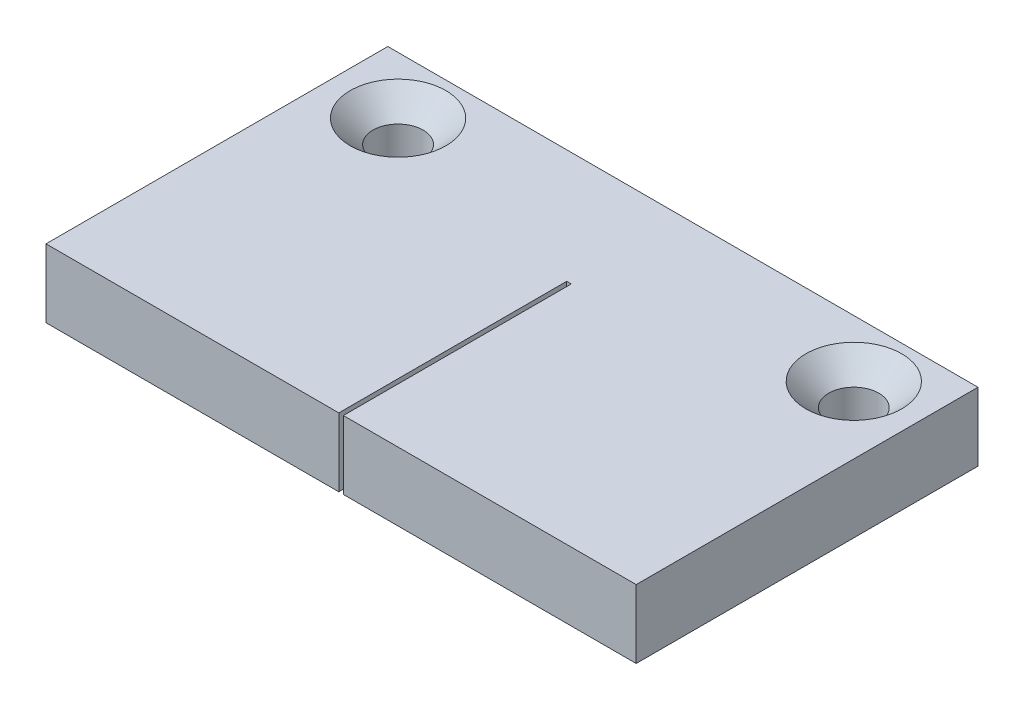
ISO-10303-21;
HEADER;
FILE_DESCRIPTION(('STEP AP214'),'2;1');
FILE_NAME('part.step','',(''),(''),'','','');
FILE_SCHEMA(('AUTOMOTIVE_DESIGN { 1 0 10303 214 1 1 1 1 }'));
ENDSEC;
DATA;
#1=APPLICATION_CONTEXT('core data for automotive mechanical design processes');
#2=APPLICATION_PROTOCOL_DEFINITION('international standard','automotive_design',2000,#1);
#3=PRODUCT_CONTEXT('',#1,'mechanical');
#4=PRODUCT('Part','Part','',(#3));
#5=PRODUCT_RELATED_PRODUCT_CATEGORY('part','',(#4));
#6=PRODUCT_DEFINITION_FORMATION('','',#4);
#7=PRODUCT_DEFINITION_CONTEXT('part definition',#1,'design');
#8=PRODUCT_DEFINITION('design','',#6,#7);
#9=PRODUCT_DEFINITION_SHAPE('','',#8);
#10=(LENGTH_UNIT() NAMED_UNIT(*) SI_UNIT(.MILLI.,.METRE.));
#11=(NAMED_UNIT(*) PLANE_ANGLE_UNIT() SI_UNIT($,.RADIAN.));
#12=(NAMED_UNIT(*) SI_UNIT($,.STERADIAN.) SOLID_ANGLE_UNIT());
#13=UNCERTAINTY_MEASURE_WITH_UNIT(LENGTH_MEASURE(1.E-05),#10,'distance_accuracy_value','');
#14=(GEOMETRIC_REPRESENTATION_CONTEXT(3) GLOBAL_UNCERTAINTY_ASSIGNED_CONTEXT((#13)) GLOBAL_UNIT_ASSIGNED_CONTEXT((#10,
#11,#12)) REPRESENTATION_CONTEXT('',''));
#15=CARTESIAN_POINT('',(0.,0.,0.));
#16=DIRECTION('',(0.,0.,1.));
#17=DIRECTION('',(1.,0.,0.));
#18=AXIS2_PLACEMENT_3D('',#15,#16,#17);
#19=CARTESIAN_POINT('',(10.,2.9999999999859,2.5));
#20=DIRECTION('',(0.,1.,0.));
#21=DIRECTION('',(0.,0.,1.));
#22=AXIS2_PLACEMENT_3D('',#19,#20,#21);
#23=CONICAL_SURFACE('',#22,2.09999999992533,0.78539816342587);
#24=CARTESIAN_POINT('',(10.,3.00000000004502,2.5));
#25=DIRECTION('',(0.,1.,0.));
#26=DIRECTION('',(0.,0.,1.));
#27=AXIS2_PLACEMENT_3D('',#24,#25,#26);
#28=CIRCLE('',#27,2.09999999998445);
#29=CARTESIAN_POINT('',(10.,3.00000000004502,4.59999999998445));
#30=VERTEX_POINT('',#29);
#31=EDGE_CURVE('E102',#30,#30,#28,.F.);
#32=ORIENTED_EDGE('',*,*,#31,.F.);
#33=EDGE_LOOP('',(#32));
#34=FACE_BOUND('',#33,.T.);
#35=CARTESIAN_POINT('',(10.,2.00000000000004,2.5));
#36=DIRECTION('',(0.,1.,0.));
#37=DIRECTION('',(-1.,0.,0.));
#38=AXIS2_PLACEMENT_3D('',#35,#36,#37);
#39=CIRCLE('',#38,1.1);
#40=CARTESIAN_POINT('',(8.90000000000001,2.00000000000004,2.5));
#41=VERTEX_POINT('',#40);
#42=EDGE_CURVE('E101',#41,#41,#39,.F.);
#43=ORIENTED_EDGE('',*,*,#42,.T.);
#44=EDGE_LOOP('',(#43));
#45=FACE_BOUND('',#44,.T.);
#46=ADVANCED_FACE('F16',(#34,#45),#23,.F.);
#47=CARTESIAN_POINT('',(-10.,2.9999999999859,2.5));
#48=DIRECTION('',(0.,1.,0.));
#49=DIRECTION('',(0.,0.,1.));
#50=AXIS2_PLACEMENT_3D('',#47,#48,#49);
#51=CONICAL_SURFACE('',#50,2.10000000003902,0.785398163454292);
#52=CARTESIAN_POINT('',(-10.,3.00000000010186,2.5));
#53=DIRECTION('',(0.,1.,0.));
#54=DIRECTION('',(0.,0.,1.));
#55=AXIS2_PLACEMENT_3D('',#52,#53,#54);
#56=CIRCLE('',#55,2.10000000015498);
#57=CARTESIAN_POINT('',(-10.,3.00000000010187,4.60000000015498));
#58=VERTEX_POINT('',#57);
#59=EDGE_CURVE('E19',#58,#58,#56,.F.);
#60=ORIENTED_EDGE('',*,*,#59,.F.);
#61=EDGE_LOOP('',(#60));
#62=FACE_BOUND('',#61,.T.);
#63=CARTESIAN_POINT('',(-10.,2.,2.5));
#64=DIRECTION('',(0.,1.,0.));
#65=DIRECTION('',(-1.,0.,0.));
#66=AXIS2_PLACEMENT_3D('',#63,#64,#65);
#67=CIRCLE('',#66,1.1);
#68=CARTESIAN_POINT('',(-11.1,2.,2.5));
#69=VERTEX_POINT('',#68);
#70=EDGE_CURVE('E112',#69,#69,#67,.F.);
#71=ORIENTED_EDGE('',*,*,#70,.T.);
#72=EDGE_LOOP('',(#71));
#73=FACE_BOUND('',#72,.T.);
#74=ADVANCED_FACE('F133',(#62,#73),#51,.F.);
#75=CARTESIAN_POINT('',(-0.099999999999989,0.,5.));
#76=DIRECTION('',(0.,0.,-1.));
#77=DIRECTION('',(-1.,0.,0.));
#78=AXIS2_PLACEMENT_3D('',#75,#76,#77);
#79=PLANE('',#78);
#80=DIRECTION('',(0.,-1.,0.));
#81=VECTOR('',#80,1.);
#82=CARTESIAN_POINT('',(-0.099999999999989,0.,5.));
#83=LINE('',#82,#81);
#84=CARTESIAN_POINT('',(-0.099999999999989,3.,5.));
#85=VERTEX_POINT('',#84);
#86=CARTESIAN_POINT('',(-0.099999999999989,0.,5.));
#87=VERTEX_POINT('',#86);
#88=EDGE_CURVE('E84',#85,#87,#83,.T.);
#89=ORIENTED_EDGE('',*,*,#88,.T.);
#90=DIRECTION('',(-1.,0.,0.));
#91=VECTOR('',#90,1.);
#92=CARTESIAN_POINT('',(-0.099999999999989,0.,5.));
#93=LINE('',#92,#91);
#94=CARTESIAN_POINT('',(0.099999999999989,0.,5.));
#95=VERTEX_POINT('',#94);
#96=EDGE_CURVE('E114',#95,#87,#93,.T.);
#97=ORIENTED_EDGE('',*,*,#96,.F.);
#98=DIRECTION('',(0.,1.,0.));
#99=VECTOR('',#98,1.);
#100=CARTESIAN_POINT('',(0.099999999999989,0.,5.));
#101=LINE('',#100,#99);
#102=CARTESIAN_POINT('',(0.099999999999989,3.,5.));
#103=VERTEX_POINT('',#102);
#104=EDGE_CURVE('E98',#95,#103,#101,.T.);
#105=ORIENTED_EDGE('',*,*,#104,.T.);
#106=DIRECTION('',(-1.,0.,0.));
#107=VECTOR('',#106,1.);
#108=CARTESIAN_POINT('',(0.,3.,5.));
#109=LINE('',#108,#107);
#110=EDGE_CURVE('E95',#85,#103,#109,.F.);
#111=ORIENTED_EDGE('',*,*,#110,.F.);
#112=EDGE_LOOP('',(#89,#97,#105,#111));
#113=FACE_BOUND('',#112,.T.);
#114=ADVANCED_FACE('F96',(#113),#79,.F.);
#115=CARTESIAN_POINT('',(0.,3.,0.));
#116=DIRECTION('',(0.,1.,0.));
#117=DIRECTION('',(-1.,0.,0.));
#118=AXIS2_PLACEMENT_3D('',#115,#116,#117);
#119=PLANE('',#118);
#120=DIRECTION('',(-1.,0.,0.));
#121=VECTOR('',#120,1.);
#122=CARTESIAN_POINT('',(12.95,3.,0.));
#123=LINE('',#122,#121);
#124=CARTESIAN_POINT('',(-12.95,3.,0.));
#125=VERTEX_POINT('',#124);
#126=CARTESIAN_POINT('',(12.95,3.00000000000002,0.));
#127=VERTEX_POINT('',#126);
#128=EDGE_CURVE('E272',#125,#127,#123,.F.);
#129=ORIENTED_EDGE('',*,*,#128,.F.);
#130=DIRECTION('',(0.,0.,1.));
#131=VECTOR('',#130,1.);
#132=CARTESIAN_POINT('',(-12.95,3.,0.));
#133=LINE('',#132,#131);
#134=CARTESIAN_POINT('',(-12.95,3.,15.));
#135=VERTEX_POINT('',#134);
#136=EDGE_CURVE('E126',#135,#125,#133,.F.);
#137=ORIENTED_EDGE('',*,*,#136,.F.);
#138=DIRECTION('',(1.,0.,0.));
#139=VECTOR('',#138,1.);
#140=CARTESIAN_POINT('',(-12.95,3.,15.));
#141=LINE('',#140,#139);
#142=CARTESIAN_POINT('',(-0.099999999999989,3.,15.));
#143=VERTEX_POINT('',#142);
#144=EDGE_CURVE('E78',#143,#135,#141,.F.);
#145=ORIENTED_EDGE('',*,*,#144,.F.);
#146=DIRECTION('',(0.,0.,1.));
#147=VECTOR('',#146,1.);
#148=CARTESIAN_POINT('',(-0.099999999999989,3.,15.));
#149=LINE('',#148,#147);
#150=EDGE_CURVE('E87',#143,#85,#149,.F.);
#151=ORIENTED_EDGE('',*,*,#150,.T.);
#152=ORIENTED_EDGE('',*,*,#110,.T.);
#153=DIRECTION('',(0.,0.,1.));
#154=VECTOR('',#153,1.);
#155=CARTESIAN_POINT('',(0.099999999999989,3.,5.));
#156=LINE('',#155,#154);
#157=CARTESIAN_POINT('',(0.099999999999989,3.00000000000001,15.));
#158=VERTEX_POINT('',#157);
#159=EDGE_CURVE('E107',#103,#158,#156,.T.);
#160=ORIENTED_EDGE('',*,*,#159,.T.);
#161=DIRECTION('',(1.,0.,0.));
#162=VECTOR('',#161,1.);
#163=CARTESIAN_POINT('',(-12.95,3.00000000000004,15.));
#164=LINE('',#163,#162);
#165=CARTESIAN_POINT('',(12.95,3.00000000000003,15.));
#166=VERTEX_POINT('',#165);
#167=EDGE_CURVE('E288',#166,#158,#164,.F.);
#168=ORIENTED_EDGE('',*,*,#167,.F.);
#169=DIRECTION('',(0.,0.,1.));
#170=VECTOR('',#169,1.);
#171=CARTESIAN_POINT('',(12.95,3.00000000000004,15.));
#172=LINE('',#171,#170);
#173=EDGE_CURVE('E281',#127,#166,#172,.T.);
#174=ORIENTED_EDGE('',*,*,#173,.F.);
#175=EDGE_LOOP('',(#129,#137,#145,#151,#152,#160,#168,#174));
#176=FACE_BOUND('',#175,.T.);
#177=ORIENTED_EDGE('',*,*,#31,.T.);
#178=EDGE_LOOP('',(#177));
#179=FACE_BOUND('',#178,.T.);
#180=ORIENTED_EDGE('',*,*,#59,.T.);
#181=EDGE_LOOP('',(#180));
#182=FACE_BOUND('',#181,.T.);
#183=ADVANCED_FACE('F104',(#176,#179,#182),#119,.T.);
#184=CARTESIAN_POINT('',(10.,0.,2.5));
#185=DIRECTION('',(0.,1.,0.));
#186=DIRECTION('',(-1.,0.,0.));
#187=AXIS2_PLACEMENT_3D('',#184,#185,#186);
#188=CYLINDRICAL_SURFACE('',#187,1.1);
#189=ORIENTED_EDGE('',*,*,#42,.F.);
#190=EDGE_LOOP('',(#189));
#191=FACE_BOUND('',#190,.T.);
#192=CARTESIAN_POINT('',(10.,0.,2.5));
#193=DIRECTION('',(0.,1.,0.));
#194=DIRECTION('',(-1.,0.,0.));
#195=AXIS2_PLACEMENT_3D('',#192,#193,#194);
#196=CIRCLE('',#195,1.1);
#197=CARTESIAN_POINT('',(8.90000000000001,0.,2.5));
#198=VERTEX_POINT('',#197);
#199=EDGE_CURVE('E124',#198,#198,#196,.F.);
#200=ORIENTED_EDGE('',*,*,#199,.T.);
#201=EDGE_LOOP('',(#200));
#202=FACE_BOUND('',#201,.T.);
#203=ADVANCED_FACE('F142',(#191,#202),#188,.F.);
#204=CARTESIAN_POINT('',(-10.,0.,2.5));
#205=DIRECTION('',(0.,1.,0.));
#206=DIRECTION('',(-1.,0.,0.));
#207=AXIS2_PLACEMENT_3D('',#204,#205,#206);
#208=CYLINDRICAL_SURFACE('',#207,1.1);
#209=ORIENTED_EDGE('',*,*,#70,.F.);
#210=EDGE_LOOP('',(#209));
#211=FACE_BOUND('',#210,.T.);
#212=CARTESIAN_POINT('',(-10.,0.,2.5));
#213=DIRECTION('',(0.,1.,0.));
#214=DIRECTION('',(-1.,0.,0.));
#215=AXIS2_PLACEMENT_3D('',#212,#213,#214);
#216=CIRCLE('',#215,1.1);
#217=CARTESIAN_POINT('',(-11.1,0.,2.5));
#218=VERTEX_POINT('',#217);
#219=EDGE_CURVE('E120',#218,#218,#216,.F.);
#220=ORIENTED_EDGE('',*,*,#219,.T.);
#221=EDGE_LOOP('',(#220));
#222=FACE_BOUND('',#221,.T.);
#223=ADVANCED_FACE('F138',(#211,#222),#208,.F.);
#224=CARTESIAN_POINT('',(-12.95,0.,15.));
#225=DIRECTION('',(0.,0.,1.));
#226=DIRECTION('',(1.,0.,0.));
#227=AXIS2_PLACEMENT_3D('',#224,#225,#226);
#228=PLANE('',#227);
#229=ORIENTED_EDGE('',*,*,#144,.T.);
#230=DIRECTION('',(0.,-1.,0.));
#231=VECTOR('',#230,1.);
#232=CARTESIAN_POINT('',(-12.95,0.,15.));
#233=LINE('',#232,#231);
#234=CARTESIAN_POINT('',(-12.95,0.,15.));
#235=VERTEX_POINT('',#234);
#236=EDGE_CURVE('E268',#235,#135,#233,.F.);
#237=ORIENTED_EDGE('',*,*,#236,.F.);
#238=DIRECTION('',(-1.,0.,0.));
#239=VECTOR('',#238,1.);
#240=CARTESIAN_POINT('',(0.,0.,15.));
#241=LINE('',#240,#239);
#242=CARTESIAN_POINT('',(-0.099999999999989,0.,15.));
#243=VERTEX_POINT('',#242);
#244=EDGE_CURVE('E123',#235,#243,#241,.F.);
#245=ORIENTED_EDGE('',*,*,#244,.T.);
#246=DIRECTION('',(0.,-1.,0.));
#247=VECTOR('',#246,1.);
#248=CARTESIAN_POINT('',(-0.099999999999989,0.,15.));
#249=LINE('',#248,#247);
#250=EDGE_CURVE('E92',#243,#143,#249,.F.);
#251=ORIENTED_EDGE('',*,*,#250,.T.);
#252=EDGE_LOOP('',(#229,#237,#245,#251));
#253=FACE_BOUND('',#252,.T.);
#254=ADVANCED_FACE('F141',(#253),#228,.T.);
#255=CARTESIAN_POINT('',(-0.099999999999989,0.,15.));
#256=DIRECTION('',(-1.,0.,0.));
#257=DIRECTION('',(0.,-1.,0.));
#258=AXIS2_PLACEMENT_3D('',#255,#256,#257);
#259=PLANE('',#258);
#260=ORIENTED_EDGE('',*,*,#250,.F.);
#261=DIRECTION('',(0.,0.,1.));
#262=VECTOR('',#261,1.);
#263=CARTESIAN_POINT('',(-0.099999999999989,0.,0.));
#264=LINE('',#263,#262);
#265=EDGE_CURVE('E90',#243,#87,#264,.F.);
#266=ORIENTED_EDGE('',*,*,#265,.T.);
#267=ORIENTED_EDGE('',*,*,#88,.F.);
#268=ORIENTED_EDGE('',*,*,#150,.F.);
#269=EDGE_LOOP('',(#260,#266,#267,#268));
#270=FACE_BOUND('',#269,.T.);
#271=ADVANCED_FACE('F86',(#270),#259,.F.);
#272=CARTESIAN_POINT('',(0.099999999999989,0.,5.));
#273=DIRECTION('',(1.,0.,0.));
#274=DIRECTION('',(0.,1.,0.));
#275=AXIS2_PLACEMENT_3D('',#272,#273,#274);
#276=PLANE('',#275);
#277=ORIENTED_EDGE('',*,*,#104,.F.);
#278=DIRECTION('',(0.,0.,1.));
#279=VECTOR('',#278,1.);
#280=CARTESIAN_POINT('',(0.099999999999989,0.,0.));
#281=LINE('',#280,#279);
#282=CARTESIAN_POINT('',(0.099999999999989,0.,15.));
#283=VERTEX_POINT('',#282);
#284=EDGE_CURVE('E292',#95,#283,#281,.T.);
#285=ORIENTED_EDGE('',*,*,#284,.T.);
#286=DIRECTION('',(0.,1.,0.));
#287=VECTOR('',#286,1.);
#288=CARTESIAN_POINT('',(0.099999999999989,0.,15.));
#289=LINE('',#288,#287);
#290=EDGE_CURVE('E286',#158,#283,#289,.F.);
#291=ORIENTED_EDGE('',*,*,#290,.F.);
#292=ORIENTED_EDGE('',*,*,#159,.F.);
#293=EDGE_LOOP('',(#277,#285,#291,#292));
#294=FACE_BOUND('',#293,.T.);
#295=ADVANCED_FACE('F207',(#294),#276,.F.);
#296=CARTESIAN_POINT('',(-12.95,0.,15.));
#297=DIRECTION('',(0.,0.,1.));
#298=DIRECTION('',(1.,0.,0.));
#299=AXIS2_PLACEMENT_3D('',#296,#297,#298);
#300=PLANE('',#299);
#301=DIRECTION('',(-1.,0.,0.));
#302=VECTOR('',#301,1.);
#303=CARTESIAN_POINT('',(0.,0.,15.));
#304=LINE('',#303,#302);
#305=CARTESIAN_POINT('',(12.95,0.,15.));
#306=VERTEX_POINT('',#305);
#307=EDGE_CURVE('E296',#283,#306,#304,.F.);
#308=ORIENTED_EDGE('',*,*,#307,.T.);
#309=DIRECTION('',(0.,1.,0.));
#310=VECTOR('',#309,1.);
#311=CARTESIAN_POINT('',(12.95,0.,15.));
#312=LINE('',#311,#310);
#313=EDGE_CURVE('E284',#166,#306,#312,.F.);
#314=ORIENTED_EDGE('',*,*,#313,.F.);
#315=ORIENTED_EDGE('',*,*,#167,.T.);
#316=ORIENTED_EDGE('',*,*,#290,.T.);
#317=EDGE_LOOP('',(#308,#314,#315,#316));
#318=FACE_BOUND('',#317,.T.);
#319=ADVANCED_FACE('F216',(#318),#300,.T.);
#320=CARTESIAN_POINT('',(12.95,0.,15.));
#321=DIRECTION('',(1.,0.,0.));
#322=DIRECTION('',(0.,1.,0.));
#323=AXIS2_PLACEMENT_3D('',#320,#321,#322);
#324=PLANE('',#323);
#325=DIRECTION('',(0.,1.,0.));
#326=VECTOR('',#325,1.);
#327=CARTESIAN_POINT('',(12.95,0.,0.));
#328=LINE('',#327,#326);
#329=CARTESIAN_POINT('',(12.95,0.,0.));
#330=VERTEX_POINT('',#329);
#331=EDGE_CURVE('E279',#127,#330,#328,.F.);
#332=ORIENTED_EDGE('',*,*,#331,.F.);
#333=ORIENTED_EDGE('',*,*,#173,.T.);
#334=ORIENTED_EDGE('',*,*,#313,.T.);
#335=DIRECTION('',(0.,0.,1.));
#336=VECTOR('',#335,1.);
#337=CARTESIAN_POINT('',(12.95,0.,0.));
#338=LINE('',#337,#336);
#339=EDGE_CURVE('E300',#306,#330,#338,.F.);
#340=ORIENTED_EDGE('',*,*,#339,.T.);
#341=EDGE_LOOP('',(#332,#333,#334,#340));
#342=FACE_BOUND('',#341,.T.);
#343=ADVANCED_FACE('F226',(#342),#324,.T.);
#344=CARTESIAN_POINT('',(12.95,0.,0.));
#345=DIRECTION('',(0.,0.,-1.));
#346=DIRECTION('',(-1.,0.,0.));
#347=AXIS2_PLACEMENT_3D('',#344,#345,#346);
#348=PLANE('',#347);
#349=DIRECTION('',(0.,-1.,0.));
#350=VECTOR('',#349,1.);
#351=CARTESIAN_POINT('',(-12.95,0.,0.));
#352=LINE('',#351,#350);
#353=CARTESIAN_POINT('',(-12.95,0.,0.));
#354=VERTEX_POINT('',#353);
#355=EDGE_CURVE('E33',#125,#354,#352,.T.);
#356=ORIENTED_EDGE('',*,*,#355,.F.);
#357=ORIENTED_EDGE('',*,*,#128,.T.);
#358=ORIENTED_EDGE('',*,*,#331,.T.);
#359=DIRECTION('',(-1.,0.,0.));
#360=VECTOR('',#359,1.);
#361=CARTESIAN_POINT('',(0.,0.,0.));
#362=LINE('',#361,#360);
#363=EDGE_CURVE('E25',#330,#354,#362,.T.);
#364=ORIENTED_EDGE('',*,*,#363,.T.);
#365=EDGE_LOOP('',(#356,#357,#358,#364));
#366=FACE_BOUND('',#365,.T.);
#367=ADVANCED_FACE('F236',(#366),#348,.T.);
#368=CARTESIAN_POINT('',(-12.95,0.,0.));
#369=DIRECTION('',(-1.,0.,0.));
#370=DIRECTION('',(0.,-1.,0.));
#371=AXIS2_PLACEMENT_3D('',#368,#369,#370);
#372=PLANE('',#371);
#373=ORIENTED_EDGE('',*,*,#236,.T.);
#374=ORIENTED_EDGE('',*,*,#136,.T.);
#375=ORIENTED_EDGE('',*,*,#355,.T.);
#376=DIRECTION('',(0.,0.,1.));
#377=VECTOR('',#376,1.);
#378=CARTESIAN_POINT('',(-12.95,0.,0.));
#379=LINE('',#378,#377);
#380=EDGE_CURVE('E11',#354,#235,#379,.T.);
#381=ORIENTED_EDGE('',*,*,#380,.T.);
#382=EDGE_LOOP('',(#373,#374,#375,#381));
#383=FACE_BOUND('',#382,.T.);
#384=ADVANCED_FACE('F149',(#383),#372,.T.);
#385=CARTESIAN_POINT('',(0.,0.,0.));
#386=DIRECTION('',(0.,1.,0.));
#387=DIRECTION('',(-1.,0.,0.));
#388=AXIS2_PLACEMENT_3D('',#385,#386,#387);
#389=PLANE('',#388);
#390=ORIENTED_EDGE('',*,*,#363,.F.);
#391=ORIENTED_EDGE('',*,*,#339,.F.);
#392=ORIENTED_EDGE('',*,*,#307,.F.);
#393=ORIENTED_EDGE('',*,*,#284,.F.);
#394=ORIENTED_EDGE('',*,*,#96,.T.);
#395=ORIENTED_EDGE('',*,*,#265,.F.);
#396=ORIENTED_EDGE('',*,*,#244,.F.);
#397=ORIENTED_EDGE('',*,*,#380,.F.);
#398=EDGE_LOOP('',(#390,#391,#392,#393,#394,#395,#396,#397));
#399=FACE_BOUND('',#398,.T.);
#400=ORIENTED_EDGE('',*,*,#219,.F.);
#401=EDGE_LOOP('',(#400));
#402=FACE_BOUND('',#401,.T.);
#403=ORIENTED_EDGE('',*,*,#199,.F.);
#404=EDGE_LOOP('',(#403));
#405=FACE_BOUND('',#404,.T.);
#406=ADVANCED_FACE('F146',(#399,#402,#405),#389,.F.);
#407=CLOSED_SHELL('',(#46,#74,#114,#183,#203,#223,#254,#271,#295,#319,#343,#367,#384,#406));
#408=MANIFOLD_SOLID_BREP('B1',#407);
#409=ADVANCED_BREP_SHAPE_REPRESENTATION('',(#18,#408),#14);
#410=SHAPE_DEFINITION_REPRESENTATION(#9,#409);
ENDSEC;
END-ISO-10303-21;
